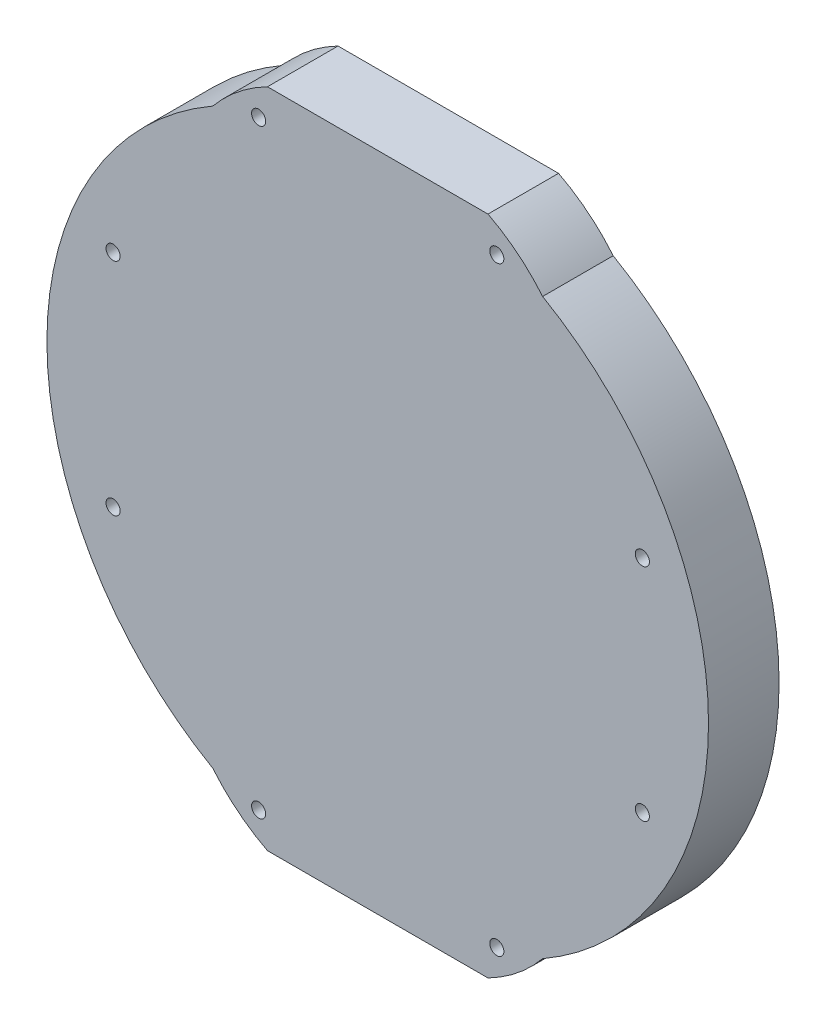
ISO-10303-21;
HEADER;
FILE_DESCRIPTION(('STEP AP214'),'2;1');
FILE_NAME('part.step','',(''),(''),'','','');
FILE_SCHEMA(('AUTOMOTIVE_DESIGN { 1 0 10303 214 1 1 1 1 }'));
ENDSEC;
DATA;
#1=APPLICATION_CONTEXT('core data for automotive mechanical design processes');
#2=APPLICATION_PROTOCOL_DEFINITION('international standard','automotive_design',2000,#1);
#3=PRODUCT_CONTEXT('',#1,'mechanical');
#4=PRODUCT('Part','Part','',(#3));
#5=PRODUCT_RELATED_PRODUCT_CATEGORY('part','',(#4));
#6=PRODUCT_DEFINITION_FORMATION('','',#4);
#7=PRODUCT_DEFINITION_CONTEXT('part definition',#1,'design');
#8=PRODUCT_DEFINITION('design','',#6,#7);
#9=PRODUCT_DEFINITION_SHAPE('','',#8);
#10=(LENGTH_UNIT() NAMED_UNIT(*) SI_UNIT(.MILLI.,.METRE.));
#11=(NAMED_UNIT(*) PLANE_ANGLE_UNIT() SI_UNIT($,.RADIAN.));
#12=(NAMED_UNIT(*) SI_UNIT($,.STERADIAN.) SOLID_ANGLE_UNIT());
#13=UNCERTAINTY_MEASURE_WITH_UNIT(LENGTH_MEASURE(1.E-05),#10,'distance_accuracy_value','');
#14=(GEOMETRIC_REPRESENTATION_CONTEXT(3) GLOBAL_UNCERTAINTY_ASSIGNED_CONTEXT((#13)) GLOBAL_UNIT_ASSIGNED_CONTEXT((#10,
#11,#12)) REPRESENTATION_CONTEXT('',''));
#15=CARTESIAN_POINT('',(0.,0.,0.));
#16=DIRECTION('',(0.,0.,1.));
#17=DIRECTION('',(1.,0.,0.));
#18=AXIS2_PLACEMENT_3D('',#15,#16,#17);
#19=CARTESIAN_POINT('',(0.,0.,16.));
#20=DIRECTION('',(0.,0.,-1.));
#21=DIRECTION('',(-1.,0.,0.));
#22=AXIS2_PLACEMENT_3D('',#19,#20,#21);
#23=CYLINDRICAL_SURFACE('',#22,75.);
#24=CARTESIAN_POINT('',(0.,0.,0.));
#25=DIRECTION('',(0.,0.,1.));
#26=DIRECTION('',(1.,0.,0.));
#27=AXIS2_PLACEMENT_3D('',#24,#25,#26);
#28=CIRCLE('',#27,75.);
#29=CARTESIAN_POINT('',(37.3910769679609,-65.0146703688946,0.));
#30=VERTEX_POINT('',#29);
#31=CARTESIAN_POINT('',(37.3910769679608,65.0146703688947,0.));
#32=VERTEX_POINT('',#31);
#33=EDGE_CURVE('E157',#30,#32,#28,.T.);
#34=ORIENTED_EDGE('',*,*,#33,.T.);
#35=DIRECTION('',(0.,0.,-1.));
#36=VECTOR('',#35,1.);
#37=CARTESIAN_POINT('',(37.3910769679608,65.0146703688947,16.));
#38=LINE('',#37,#36);
#39=CARTESIAN_POINT('',(37.3910769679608,65.0146703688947,16.));
#40=VERTEX_POINT('',#39);
#41=EDGE_CURVE('E11',#40,#32,#38,.T.);
#42=ORIENTED_EDGE('',*,*,#41,.F.);
#43=CARTESIAN_POINT('',(0.,0.,16.));
#44=DIRECTION('',(0.,0.,1.));
#45=DIRECTION('',(1.,0.,0.));
#46=AXIS2_PLACEMENT_3D('',#43,#44,#45);
#47=CIRCLE('',#46,75.);
#48=CARTESIAN_POINT('',(37.3910769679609,-65.0146703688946,16.));
#49=VERTEX_POINT('',#48);
#50=EDGE_CURVE('E90',#49,#40,#47,.T.);
#51=ORIENTED_EDGE('',*,*,#50,.F.);
#52=DIRECTION('',(0.,0.,-1.));
#53=VECTOR('',#52,1.);
#54=CARTESIAN_POINT('',(37.3910769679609,-65.0146703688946,16.));
#55=LINE('',#54,#53);
#56=EDGE_CURVE('E138',#49,#30,#55,.T.);
#57=ORIENTED_EDGE('',*,*,#56,.T.);
#58=EDGE_LOOP('',(#34,#42,#51,#57));
#59=FACE_BOUND('',#58,.T.);
#60=ADVANCED_FACE('F34',(#59),#23,.T.);
#61=CARTESIAN_POINT('',(6.88495550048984,39.8396475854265,16.));
#62=DIRECTION('',(0.,0.,-1.));
#63=DIRECTION('',(-1.,0.,0.));
#64=AXIS2_PLACEMENT_3D('',#61,#62,#63);
#65=CYLINDRICAL_SURFACE('',#64,39.5525627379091);
#66=CARTESIAN_POINT('',(6.88495550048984,39.8396475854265,0.));
#67=DIRECTION('',(0.,0.,1.));
#68=DIRECTION('',(1.,0.,0.));
#69=AXIS2_PLACEMENT_3D('',#66,#67,#68);
#70=CIRCLE('',#69,39.5525627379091);
#71=CARTESIAN_POINT('',(25.,75.,0.));
#72=VERTEX_POINT('',#71);
#73=EDGE_CURVE('E160',#72,#32,#70,.F.);
#74=ORIENTED_EDGE('',*,*,#73,.F.);
#75=DIRECTION('',(0.,0.,-1.));
#76=VECTOR('',#75,1.);
#77=CARTESIAN_POINT('',(25.,75.,16.));
#78=LINE('',#77,#76);
#79=CARTESIAN_POINT('',(25.,75.,16.));
#80=VERTEX_POINT('',#79);
#81=EDGE_CURVE('E43',#80,#72,#78,.T.);
#82=ORIENTED_EDGE('',*,*,#81,.F.);
#83=CARTESIAN_POINT('',(6.88495550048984,39.8396475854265,16.));
#84=DIRECTION('',(0.,0.,1.));
#85=DIRECTION('',(1.,0.,0.));
#86=AXIS2_PLACEMENT_3D('',#83,#84,#85);
#87=CIRCLE('',#86,39.5525627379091);
#88=EDGE_CURVE('E441',#80,#40,#87,.F.);
#89=ORIENTED_EDGE('',*,*,#88,.T.);
#90=ORIENTED_EDGE('',*,*,#41,.T.);
#91=EDGE_LOOP('',(#74,#82,#89,#90));
#92=FACE_BOUND('',#91,.T.);
#93=ADVANCED_FACE('F195',(#92),#65,.T.);
#94=CARTESIAN_POINT('',(0.,75.,16.));
#95=DIRECTION('',(0.,1.,0.));
#96=DIRECTION('',(0.,0.,1.));
#97=AXIS2_PLACEMENT_3D('',#94,#95,#96);
#98=PLANE('',#97);
#99=DIRECTION('',(1.,0.,0.));
#100=VECTOR('',#99,1.);
#101=CARTESIAN_POINT('',(0.,75.,0.));
#102=LINE('',#101,#100);
#103=CARTESIAN_POINT('',(-25.,75.,0.));
#104=VERTEX_POINT('',#103);
#105=EDGE_CURVE('E164',#104,#72,#102,.T.);
#106=ORIENTED_EDGE('',*,*,#105,.F.);
#107=DIRECTION('',(0.,0.,-1.));
#108=VECTOR('',#107,1.);
#109=CARTESIAN_POINT('',(-25.,75.,16.));
#110=LINE('',#109,#108);
#111=CARTESIAN_POINT('',(-25.,75.,16.));
#112=VERTEX_POINT('',#111);
#113=EDGE_CURVE('E185',#112,#104,#110,.T.);
#114=ORIENTED_EDGE('',*,*,#113,.F.);
#115=DIRECTION('',(1.,0.,0.));
#116=VECTOR('',#115,1.);
#117=CARTESIAN_POINT('',(0.,75.,16.));
#118=LINE('',#117,#116);
#119=EDGE_CURVE('E192',#112,#80,#118,.T.);
#120=ORIENTED_EDGE('',*,*,#119,.T.);
#121=ORIENTED_EDGE('',*,*,#81,.T.);
#122=EDGE_LOOP('',(#106,#114,#120,#121));
#123=FACE_BOUND('',#122,.T.);
#124=ADVANCED_FACE('F190',(#123),#98,.T.);
#125=CARTESIAN_POINT('',(-6.88495550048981,39.8396475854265,16.));
#126=DIRECTION('',(0.,0.,-1.));
#127=DIRECTION('',(-1.,0.,0.));
#128=AXIS2_PLACEMENT_3D('',#125,#126,#127);
#129=CYLINDRICAL_SURFACE('',#128,39.5525627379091);
#130=CARTESIAN_POINT('',(-6.88495550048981,39.8396475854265,0.));
#131=DIRECTION('',(0.,0.,1.));
#132=DIRECTION('',(1.,0.,0.));
#133=AXIS2_PLACEMENT_3D('',#130,#131,#132);
#134=CIRCLE('',#133,39.5525627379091);
#135=CARTESIAN_POINT('',(-37.3910769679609,65.0146703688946,0.));
#136=VERTEX_POINT('',#135);
#137=EDGE_CURVE('E167',#104,#136,#134,.T.);
#138=ORIENTED_EDGE('',*,*,#137,.T.);
#139=DIRECTION('',(0.,0.,-1.));
#140=VECTOR('',#139,1.);
#141=CARTESIAN_POINT('',(-37.3910769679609,65.0146703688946,16.));
#142=LINE('',#141,#140);
#143=CARTESIAN_POINT('',(-37.3910769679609,65.0146703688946,16.));
#144=VERTEX_POINT('',#143);
#145=EDGE_CURVE('E182',#144,#136,#142,.T.);
#146=ORIENTED_EDGE('',*,*,#145,.F.);
#147=CARTESIAN_POINT('',(-6.88495550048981,39.8396475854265,16.));
#148=DIRECTION('',(0.,0.,1.));
#149=DIRECTION('',(1.,0.,0.));
#150=AXIS2_PLACEMENT_3D('',#147,#148,#149);
#151=CIRCLE('',#150,39.5525627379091);
#152=EDGE_CURVE('E126',#112,#144,#151,.T.);
#153=ORIENTED_EDGE('',*,*,#152,.F.);
#154=ORIENTED_EDGE('',*,*,#113,.T.);
#155=EDGE_LOOP('',(#138,#146,#153,#154));
#156=FACE_BOUND('',#155,.T.);
#157=ADVANCED_FACE('F205',(#156),#129,.T.);
#158=CARTESIAN_POINT('',(-37.3910769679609,-65.0146703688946,0.));
#159=VERTEX_POINT('',#158);
#160=EDGE_CURVE('E161',#136,#159,#28,.T.);
#161=ORIENTED_EDGE('',*,*,#160,.T.);
#162=DIRECTION('',(0.,0.,-1.));
#163=VECTOR('',#162,1.);
#164=CARTESIAN_POINT('',(-37.3910769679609,-65.0146703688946,16.));
#165=LINE('',#164,#163);
#166=CARTESIAN_POINT('',(-37.3910769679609,-65.0146703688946,16.));
#167=VERTEX_POINT('',#166);
#168=EDGE_CURVE('E114',#167,#159,#165,.T.);
#169=ORIENTED_EDGE('',*,*,#168,.F.);
#170=EDGE_CURVE('E123',#144,#167,#47,.T.);
#171=ORIENTED_EDGE('',*,*,#170,.F.);
#172=ORIENTED_EDGE('',*,*,#145,.T.);
#173=EDGE_LOOP('',(#161,#169,#171,#172));
#174=FACE_BOUND('',#173,.T.);
#175=ADVANCED_FACE('F208',(#174),#23,.T.);
#176=CARTESIAN_POINT('',(-6.88495550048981,-39.8396475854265,16.));
#177=DIRECTION('',(0.,0.,-1.));
#178=DIRECTION('',(-1.,0.,0.));
#179=AXIS2_PLACEMENT_3D('',#176,#177,#178);
#180=CYLINDRICAL_SURFACE('',#179,39.5525627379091);
#181=CARTESIAN_POINT('',(-6.88495550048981,-39.8396475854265,0.));
#182=DIRECTION('',(0.,0.,1.));
#183=DIRECTION('',(1.,0.,0.));
#184=AXIS2_PLACEMENT_3D('',#181,#182,#183);
#185=CIRCLE('',#184,39.5525627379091);
#186=CARTESIAN_POINT('',(-25.,-75.,0.));
#187=VERTEX_POINT('',#186);
#188=EDGE_CURVE('E113',#187,#159,#185,.F.);
#189=ORIENTED_EDGE('',*,*,#188,.F.);
#190=DIRECTION('',(0.,0.,-1.));
#191=VECTOR('',#190,1.);
#192=CARTESIAN_POINT('',(-25.,-75.,16.));
#193=LINE('',#192,#191);
#194=CARTESIAN_POINT('',(-25.,-75.,16.));
#195=VERTEX_POINT('',#194);
#196=EDGE_CURVE('E107',#195,#187,#193,.T.);
#197=ORIENTED_EDGE('',*,*,#196,.F.);
#198=CARTESIAN_POINT('',(-6.88495550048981,-39.8396475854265,16.));
#199=DIRECTION('',(0.,0.,1.));
#200=DIRECTION('',(1.,0.,0.));
#201=AXIS2_PLACEMENT_3D('',#198,#199,#200);
#202=CIRCLE('',#201,39.5525627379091);
#203=EDGE_CURVE('E111',#195,#167,#202,.F.);
#204=ORIENTED_EDGE('',*,*,#203,.T.);
#205=ORIENTED_EDGE('',*,*,#168,.T.);
#206=EDGE_LOOP('',(#189,#197,#204,#205));
#207=FACE_BOUND('',#206,.T.);
#208=ADVANCED_FACE('F109',(#207),#180,.T.);
#209=CARTESIAN_POINT('',(0.,-75.,16.));
#210=DIRECTION('',(0.,1.,0.));
#211=DIRECTION('',(0.,0.,1.));
#212=AXIS2_PLACEMENT_3D('',#209,#210,#211);
#213=PLANE('',#212);
#214=DIRECTION('',(1.,0.,0.));
#215=VECTOR('',#214,1.);
#216=CARTESIAN_POINT('',(0.,-75.,0.));
#217=LINE('',#216,#215);
#218=CARTESIAN_POINT('',(25.,-75.,0.));
#219=VERTEX_POINT('',#218);
#220=EDGE_CURVE('E78',#187,#219,#217,.T.);
#221=ORIENTED_EDGE('',*,*,#220,.T.);
#222=DIRECTION('',(0.,0.,-1.));
#223=VECTOR('',#222,1.);
#224=CARTESIAN_POINT('',(25.,-75.,16.));
#225=LINE('',#224,#223);
#226=CARTESIAN_POINT('',(25.,-75.,16.));
#227=VERTEX_POINT('',#226);
#228=EDGE_CURVE('E115',#227,#219,#225,.T.);
#229=ORIENTED_EDGE('',*,*,#228,.F.);
#230=DIRECTION('',(1.,0.,0.));
#231=VECTOR('',#230,1.);
#232=CARTESIAN_POINT('',(0.,-75.,16.));
#233=LINE('',#232,#231);
#234=EDGE_CURVE('E117',#195,#227,#233,.T.);
#235=ORIENTED_EDGE('',*,*,#234,.F.);
#236=ORIENTED_EDGE('',*,*,#196,.T.);
#237=EDGE_LOOP('',(#221,#229,#235,#236));
#238=FACE_BOUND('',#237,.T.);
#239=ADVANCED_FACE('F118',(#238),#213,.F.);
#240=CARTESIAN_POINT('',(27.,68.,16.));
#241=DIRECTION('',(0.,0.,-1.));
#242=DIRECTION('',(-1.,0.,0.));
#243=AXIS2_PLACEMENT_3D('',#240,#241,#242);
#244=CYLINDRICAL_SURFACE('',#243,1.6);
#245=CARTESIAN_POINT('',(27.,68.,16.));
#246=DIRECTION('',(0.,0.,1.));
#247=DIRECTION('',(1.,0.,0.));
#248=AXIS2_PLACEMENT_3D('',#245,#246,#247);
#249=CIRCLE('',#248,1.6);
#250=CARTESIAN_POINT('',(28.6,68.,16.));
#251=VERTEX_POINT('',#250);
#252=EDGE_CURVE('E132',#251,#251,#249,.F.);
#253=ORIENTED_EDGE('',*,*,#252,.F.);
#254=EDGE_LOOP('',(#253));
#255=FACE_BOUND('',#254,.T.);
#256=CARTESIAN_POINT('',(27.,68.,0.));
#257=DIRECTION('',(0.,0.,1.));
#258=DIRECTION('',(1.,0.,0.));
#259=AXIS2_PLACEMENT_3D('',#256,#257,#258);
#260=CIRCLE('',#259,1.6);
#261=CARTESIAN_POINT('',(28.6,68.,0.));
#262=VERTEX_POINT('',#261);
#263=EDGE_CURVE('E172',#262,#262,#260,.F.);
#264=ORIENTED_EDGE('',*,*,#263,.T.);
#265=EDGE_LOOP('',(#264));
#266=FACE_BOUND('',#265,.T.);
#267=ADVANCED_FACE('F213',(#255,#266),#244,.F.);
#268=CARTESIAN_POINT('',(6.88495550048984,-39.8396475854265,16.));
#269=DIRECTION('',(0.,0.,-1.));
#270=DIRECTION('',(-1.,0.,0.));
#271=AXIS2_PLACEMENT_3D('',#268,#269,#270);
#272=CYLINDRICAL_SURFACE('',#271,39.5525627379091);
#273=CARTESIAN_POINT('',(6.88495550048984,-39.8396475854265,0.));
#274=DIRECTION('',(0.,0.,1.));
#275=DIRECTION('',(1.,0.,0.));
#276=AXIS2_PLACEMENT_3D('',#273,#274,#275);
#277=CIRCLE('',#276,39.5525627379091);
#278=EDGE_CURVE('E84',#219,#30,#277,.T.);
#279=ORIENTED_EDGE('',*,*,#278,.T.);
#280=ORIENTED_EDGE('',*,*,#56,.F.);
#281=CARTESIAN_POINT('',(6.88495550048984,-39.8396475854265,16.));
#282=DIRECTION('',(0.,0.,1.));
#283=DIRECTION('',(1.,0.,0.));
#284=AXIS2_PLACEMENT_3D('',#281,#282,#283);
#285=CIRCLE('',#284,39.5525627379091);
#286=EDGE_CURVE('E51',#227,#49,#285,.T.);
#287=ORIENTED_EDGE('',*,*,#286,.F.);
#288=ORIENTED_EDGE('',*,*,#228,.T.);
#289=EDGE_LOOP('',(#279,#280,#287,#288));
#290=FACE_BOUND('',#289,.T.);
#291=ADVANCED_FACE('F210',(#290),#272,.T.);
#292=CARTESIAN_POINT('',(-27.,68.,16.));
#293=DIRECTION('',(0.,0.,-1.));
#294=DIRECTION('',(-1.,0.,0.));
#295=AXIS2_PLACEMENT_3D('',#292,#293,#294);
#296=CYLINDRICAL_SURFACE('',#295,1.6);
#297=CARTESIAN_POINT('',(-27.,68.,16.));
#298=DIRECTION('',(0.,0.,1.));
#299=DIRECTION('',(1.,0.,0.));
#300=AXIS2_PLACEMENT_3D('',#297,#298,#299);
#301=CIRCLE('',#300,1.6);
#302=CARTESIAN_POINT('',(-25.4,68.,16.));
#303=VERTEX_POINT('',#302);
#304=EDGE_CURVE('E439',#303,#303,#301,.T.);
#305=ORIENTED_EDGE('',*,*,#304,.T.);
#306=EDGE_LOOP('',(#305));
#307=FACE_BOUND('',#306,.T.);
#308=CARTESIAN_POINT('',(-27.,68.,0.));
#309=DIRECTION('',(0.,0.,1.));
#310=DIRECTION('',(1.,0.,0.));
#311=AXIS2_PLACEMENT_3D('',#308,#309,#310);
#312=CIRCLE('',#311,1.6);
#313=CARTESIAN_POINT('',(-25.4,68.,0.));
#314=VERTEX_POINT('',#313);
#315=EDGE_CURVE('E154',#314,#314,#312,.T.);
#316=ORIENTED_EDGE('',*,*,#315,.F.);
#317=EDGE_LOOP('',(#316));
#318=FACE_BOUND('',#317,.T.);
#319=ADVANCED_FACE('F212',(#307,#318),#296,.F.);
#320=CARTESIAN_POINT('',(-60.,25.,16.));
#321=DIRECTION('',(0.,0.,-1.));
#322=DIRECTION('',(-1.,0.,0.));
#323=AXIS2_PLACEMENT_3D('',#320,#321,#322);
#324=CYLINDRICAL_SURFACE('',#323,1.6);
#325=CARTESIAN_POINT('',(-60.,25.,16.));
#326=DIRECTION('',(0.,0.,1.));
#327=DIRECTION('',(1.,0.,0.));
#328=AXIS2_PLACEMENT_3D('',#325,#326,#327);
#329=CIRCLE('',#328,1.6);
#330=CARTESIAN_POINT('',(-58.4,25.,16.));
#331=VERTEX_POINT('',#330);
#332=EDGE_CURVE('E436',#331,#331,#329,.T.);
#333=ORIENTED_EDGE('',*,*,#332,.T.);
#334=EDGE_LOOP('',(#333));
#335=FACE_BOUND('',#334,.T.);
#336=CARTESIAN_POINT('',(-60.,25.,0.));
#337=DIRECTION('',(0.,0.,1.));
#338=DIRECTION('',(1.,0.,0.));
#339=AXIS2_PLACEMENT_3D('',#336,#337,#338);
#340=CIRCLE('',#339,1.6);
#341=CARTESIAN_POINT('',(-58.4,25.,0.));
#342=VERTEX_POINT('',#341);
#343=EDGE_CURVE('E151',#342,#342,#340,.T.);
#344=ORIENTED_EDGE('',*,*,#343,.F.);
#345=EDGE_LOOP('',(#344));
#346=FACE_BOUND('',#345,.T.);
#347=ADVANCED_FACE('F219',(#335,#346),#324,.F.);
#348=CARTESIAN_POINT('',(60.,25.,16.));
#349=DIRECTION('',(0.,0.,-1.));
#350=DIRECTION('',(-1.,0.,0.));
#351=AXIS2_PLACEMENT_3D('',#348,#349,#350);
#352=CYLINDRICAL_SURFACE('',#351,1.6);
#353=CARTESIAN_POINT('',(60.,25.,16.));
#354=DIRECTION('',(0.,0.,1.));
#355=DIRECTION('',(1.,0.,0.));
#356=AXIS2_PLACEMENT_3D('',#353,#354,#355);
#357=CIRCLE('',#356,1.6);
#358=CARTESIAN_POINT('',(61.6,25.,16.));
#359=VERTEX_POINT('',#358);
#360=EDGE_CURVE('E432',#359,#359,#357,.F.);
#361=ORIENTED_EDGE('',*,*,#360,.F.);
#362=EDGE_LOOP('',(#361));
#363=FACE_BOUND('',#362,.T.);
#364=CARTESIAN_POINT('',(60.,25.,0.));
#365=DIRECTION('',(0.,0.,1.));
#366=DIRECTION('',(1.,0.,0.));
#367=AXIS2_PLACEMENT_3D('',#364,#365,#366);
#368=CIRCLE('',#367,1.6);
#369=CARTESIAN_POINT('',(61.6,25.,0.));
#370=VERTEX_POINT('',#369);
#371=EDGE_CURVE('E148',#370,#370,#368,.F.);
#372=ORIENTED_EDGE('',*,*,#371,.T.);
#373=EDGE_LOOP('',(#372));
#374=FACE_BOUND('',#373,.T.);
#375=ADVANCED_FACE('F245',(#363,#374),#352,.F.);
#376=CARTESIAN_POINT('',(27.,-68.,16.));
#377=DIRECTION('',(0.,0.,-1.));
#378=DIRECTION('',(-1.,0.,0.));
#379=AXIS2_PLACEMENT_3D('',#376,#377,#378);
#380=CYLINDRICAL_SURFACE('',#379,1.6);
#381=CARTESIAN_POINT('',(27.,-68.,16.));
#382=DIRECTION('',(0.,0.,1.));
#383=DIRECTION('',(1.,0.,0.));
#384=AXIS2_PLACEMENT_3D('',#381,#382,#383);
#385=CIRCLE('',#384,1.6);
#386=CARTESIAN_POINT('',(28.6,-68.,16.));
#387=VERTEX_POINT('',#386);
#388=EDGE_CURVE('E428',#387,#387,#385,.T.);
#389=ORIENTED_EDGE('',*,*,#388,.T.);
#390=EDGE_LOOP('',(#389));
#391=FACE_BOUND('',#390,.T.);
#392=CARTESIAN_POINT('',(27.,-68.,0.));
#393=DIRECTION('',(0.,0.,1.));
#394=DIRECTION('',(1.,0.,0.));
#395=AXIS2_PLACEMENT_3D('',#392,#393,#394);
#396=CIRCLE('',#395,1.6);
#397=CARTESIAN_POINT('',(28.6,-68.,0.));
#398=VERTEX_POINT('',#397);
#399=EDGE_CURVE('E145',#398,#398,#396,.T.);
#400=ORIENTED_EDGE('',*,*,#399,.F.);
#401=EDGE_LOOP('',(#400));
#402=FACE_BOUND('',#401,.T.);
#403=ADVANCED_FACE('F249',(#391,#402),#380,.F.);
#404=CARTESIAN_POINT('',(60.,-25.,16.));
#405=DIRECTION('',(0.,0.,-1.));
#406=DIRECTION('',(-1.,0.,0.));
#407=AXIS2_PLACEMENT_3D('',#404,#405,#406);
#408=CYLINDRICAL_SURFACE('',#407,1.6);
#409=CARTESIAN_POINT('',(60.,-25.,16.));
#410=DIRECTION('',(0.,0.,1.));
#411=DIRECTION('',(1.,0.,0.));
#412=AXIS2_PLACEMENT_3D('',#409,#410,#411);
#413=CIRCLE('',#412,1.6);
#414=CARTESIAN_POINT('',(61.6,-25.,16.));
#415=VERTEX_POINT('',#414);
#416=EDGE_CURVE('E264',#415,#415,#413,.T.);
#417=ORIENTED_EDGE('',*,*,#416,.T.);
#418=EDGE_LOOP('',(#417));
#419=FACE_BOUND('',#418,.T.);
#420=CARTESIAN_POINT('',(60.,-25.,0.));
#421=DIRECTION('',(0.,0.,1.));
#422=DIRECTION('',(1.,0.,0.));
#423=AXIS2_PLACEMENT_3D('',#420,#421,#422);
#424=CIRCLE('',#423,1.6);
#425=CARTESIAN_POINT('',(61.6,-25.,0.));
#426=VERTEX_POINT('',#425);
#427=EDGE_CURVE('E142',#426,#426,#424,.T.);
#428=ORIENTED_EDGE('',*,*,#427,.F.);
#429=EDGE_LOOP('',(#428));
#430=FACE_BOUND('',#429,.T.);
#431=ADVANCED_FACE('F252',(#419,#430),#408,.F.);
#432=CARTESIAN_POINT('',(-60.,-25.,16.));
#433=DIRECTION('',(0.,0.,-1.));
#434=DIRECTION('',(-1.,0.,0.));
#435=AXIS2_PLACEMENT_3D('',#432,#433,#434);
#436=CYLINDRICAL_SURFACE('',#435,1.6);
#437=CARTESIAN_POINT('',(-60.,-25.,16.));
#438=DIRECTION('',(0.,0.,1.));
#439=DIRECTION('',(1.,0.,0.));
#440=AXIS2_PLACEMENT_3D('',#437,#438,#439);
#441=CIRCLE('',#440,1.6);
#442=CARTESIAN_POINT('',(-58.4,-25.,16.));
#443=VERTEX_POINT('',#442);
#444=EDGE_CURVE('E178',#443,#443,#441,.F.);
#445=ORIENTED_EDGE('',*,*,#444,.F.);
#446=EDGE_LOOP('',(#445));
#447=FACE_BOUND('',#446,.T.);
#448=CARTESIAN_POINT('',(-60.,-25.,0.));
#449=DIRECTION('',(0.,0.,1.));
#450=DIRECTION('',(1.,0.,0.));
#451=AXIS2_PLACEMENT_3D('',#448,#449,#450);
#452=CIRCLE('',#451,1.6);
#453=CARTESIAN_POINT('',(-58.4,-25.,0.));
#454=VERTEX_POINT('',#453);
#455=EDGE_CURVE('E139',#454,#454,#452,.F.);
#456=ORIENTED_EDGE('',*,*,#455,.T.);
#457=EDGE_LOOP('',(#456));
#458=FACE_BOUND('',#457,.T.);
#459=ADVANCED_FACE('F36',(#447,#458),#436,.F.);
#460=CARTESIAN_POINT('',(-27.,-68.,16.));
#461=DIRECTION('',(0.,0.,-1.));
#462=DIRECTION('',(-1.,0.,0.));
#463=AXIS2_PLACEMENT_3D('',#460,#461,#462);
#464=CYLINDRICAL_SURFACE('',#463,1.6);
#465=CARTESIAN_POINT('',(-27.,-68.,16.));
#466=DIRECTION('',(0.,0.,1.));
#467=DIRECTION('',(1.,0.,0.));
#468=AXIS2_PLACEMENT_3D('',#465,#466,#467);
#469=CIRCLE('',#468,1.6);
#470=CARTESIAN_POINT('',(-25.4,-68.,16.));
#471=VERTEX_POINT('',#470);
#472=EDGE_CURVE('E135',#471,#471,#469,.F.);
#473=ORIENTED_EDGE('',*,*,#472,.F.);
#474=EDGE_LOOP('',(#473));
#475=FACE_BOUND('',#474,.T.);
#476=CARTESIAN_POINT('',(-27.,-68.,0.));
#477=DIRECTION('',(0.,0.,1.));
#478=DIRECTION('',(1.,0.,0.));
#479=AXIS2_PLACEMENT_3D('',#476,#477,#478);
#480=CIRCLE('',#479,1.6);
#481=CARTESIAN_POINT('',(-25.4,-68.,0.));
#482=VERTEX_POINT('',#481);
#483=EDGE_CURVE('E175',#482,#482,#480,.F.);
#484=ORIENTED_EDGE('',*,*,#483,.T.);
#485=EDGE_LOOP('',(#484));
#486=FACE_BOUND('',#485,.T.);
#487=ADVANCED_FACE('F259',(#475,#486),#464,.F.);
#488=CARTESIAN_POINT('',(0.,0.,16.));
#489=DIRECTION('',(0.,0.,1.));
#490=DIRECTION('',(1.,0.,0.));
#491=AXIS2_PLACEMENT_3D('',#488,#489,#490);
#492=PLANE('',#491);
#493=ORIENTED_EDGE('',*,*,#444,.T.);
#494=EDGE_LOOP('',(#493));
#495=FACE_BOUND('',#494,.T.);
#496=ORIENTED_EDGE('',*,*,#416,.F.);
#497=EDGE_LOOP('',(#496));
#498=FACE_BOUND('',#497,.T.);
#499=ORIENTED_EDGE('',*,*,#388,.F.);
#500=EDGE_LOOP('',(#499));
#501=FACE_BOUND('',#500,.T.);
#502=ORIENTED_EDGE('',*,*,#360,.T.);
#503=EDGE_LOOP('',(#502));
#504=FACE_BOUND('',#503,.T.);
#505=ORIENTED_EDGE('',*,*,#332,.F.);
#506=EDGE_LOOP('',(#505));
#507=FACE_BOUND('',#506,.T.);
#508=ORIENTED_EDGE('',*,*,#304,.F.);
#509=EDGE_LOOP('',(#508));
#510=FACE_BOUND('',#509,.T.);
#511=ORIENTED_EDGE('',*,*,#50,.T.);
#512=ORIENTED_EDGE('',*,*,#88,.F.);
#513=ORIENTED_EDGE('',*,*,#119,.F.);
#514=ORIENTED_EDGE('',*,*,#152,.T.);
#515=ORIENTED_EDGE('',*,*,#170,.T.);
#516=ORIENTED_EDGE('',*,*,#203,.F.);
#517=ORIENTED_EDGE('',*,*,#234,.T.);
#518=ORIENTED_EDGE('',*,*,#286,.T.);
#519=EDGE_LOOP('',(#511,#512,#513,#514,#515,#516,#517,#518));
#520=FACE_BOUND('',#519,.T.);
#521=ORIENTED_EDGE('',*,*,#252,.T.);
#522=EDGE_LOOP('',(#521));
#523=FACE_BOUND('',#522,.T.);
#524=ORIENTED_EDGE('',*,*,#472,.T.);
#525=EDGE_LOOP('',(#524));
#526=FACE_BOUND('',#525,.T.);
#527=ADVANCED_FACE('F120',(#495,#498,#501,#504,#507,#510,#520,#523,#526),#492,.T.);
#528=CARTESIAN_POINT('',(0.,0.,0.));
#529=DIRECTION('',(0.,0.,1.));
#530=DIRECTION('',(1.,0.,0.));
#531=AXIS2_PLACEMENT_3D('',#528,#529,#530);
#532=PLANE('',#531);
#533=ORIENTED_EDGE('',*,*,#455,.F.);
#534=EDGE_LOOP('',(#533));
#535=FACE_BOUND('',#534,.T.);
#536=ORIENTED_EDGE('',*,*,#427,.T.);
#537=EDGE_LOOP('',(#536));
#538=FACE_BOUND('',#537,.T.);
#539=ORIENTED_EDGE('',*,*,#399,.T.);
#540=EDGE_LOOP('',(#539));
#541=FACE_BOUND('',#540,.T.);
#542=ORIENTED_EDGE('',*,*,#371,.F.);
#543=EDGE_LOOP('',(#542));
#544=FACE_BOUND('',#543,.T.);
#545=ORIENTED_EDGE('',*,*,#343,.T.);
#546=EDGE_LOOP('',(#545));
#547=FACE_BOUND('',#546,.T.);
#548=ORIENTED_EDGE('',*,*,#315,.T.);
#549=EDGE_LOOP('',(#548));
#550=FACE_BOUND('',#549,.T.);
#551=ORIENTED_EDGE('',*,*,#33,.F.);
#552=ORIENTED_EDGE('',*,*,#278,.F.);
#553=ORIENTED_EDGE('',*,*,#220,.F.);
#554=ORIENTED_EDGE('',*,*,#188,.T.);
#555=ORIENTED_EDGE('',*,*,#160,.F.);
#556=ORIENTED_EDGE('',*,*,#137,.F.);
#557=ORIENTED_EDGE('',*,*,#105,.T.);
#558=ORIENTED_EDGE('',*,*,#73,.T.);
#559=EDGE_LOOP('',(#551,#552,#553,#554,#555,#556,#557,#558));
#560=FACE_BOUND('',#559,.T.);
#561=ORIENTED_EDGE('',*,*,#263,.F.);
#562=EDGE_LOOP('',(#561));
#563=FACE_BOUND('',#562,.T.);
#564=ORIENTED_EDGE('',*,*,#483,.F.);
#565=EDGE_LOOP('',(#564));
#566=FACE_BOUND('',#565,.T.);
#567=ADVANCED_FACE('F199',(#535,#538,#541,#544,#547,#550,#560,#563,#566),#532,.F.);
#568=CLOSED_SHELL('',(#60,#93,#124,#157,#175,#208,#239,#267,#291,#319,#347,#375,#403,#431,#459,
#487,#527,#567));
#569=MANIFOLD_SOLID_BREP('B2',#568);
#570=ADVANCED_BREP_SHAPE_REPRESENTATION('',(#18,#569),#14);
#571=SHAPE_DEFINITION_REPRESENTATION(#9,#570);
ENDSEC;
END-ISO-10303-21;
